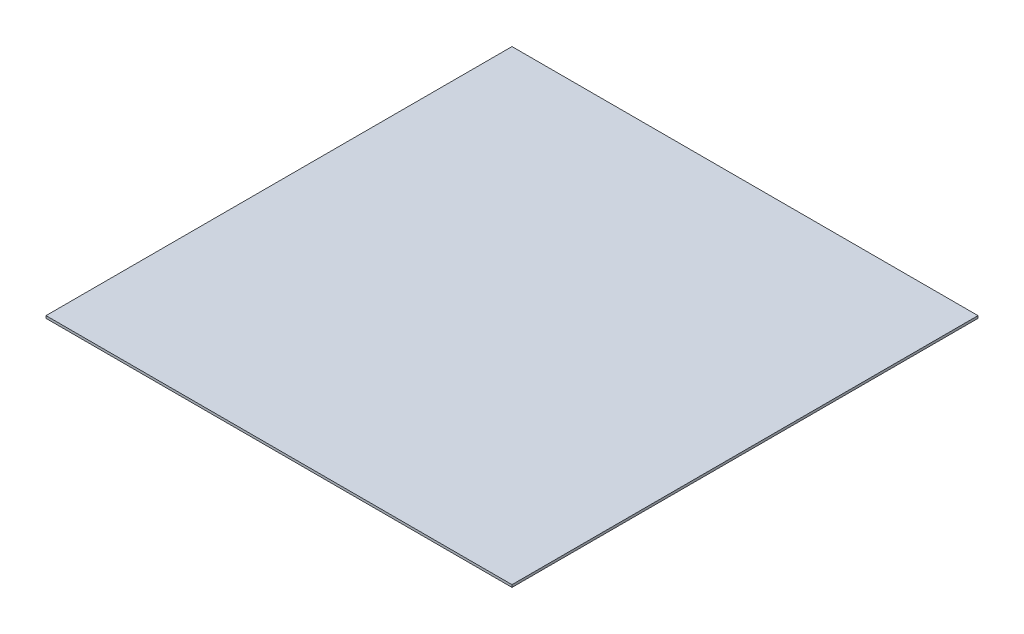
from build123d import *

# Parameters (mm, degrees)
SKETCH1_W           = 1219.2
SKETCH1_H           = 1219.2
BOSS_EXTRUDE1_DEPTH = 6.35


with BuildPart() as part:
    # Sketch1 → Boss-Extrude1 (new body)
    with BuildSketch(Plane(origin=(0, 0, 0), x_dir=(1, 0, 0), z_dir=(0, 1, 0))):
        Rectangle(SKETCH1_W, SKETCH1_H)
    extrude(amount=BOSS_EXTRUDE1_DEPTH)


solid = part.part
